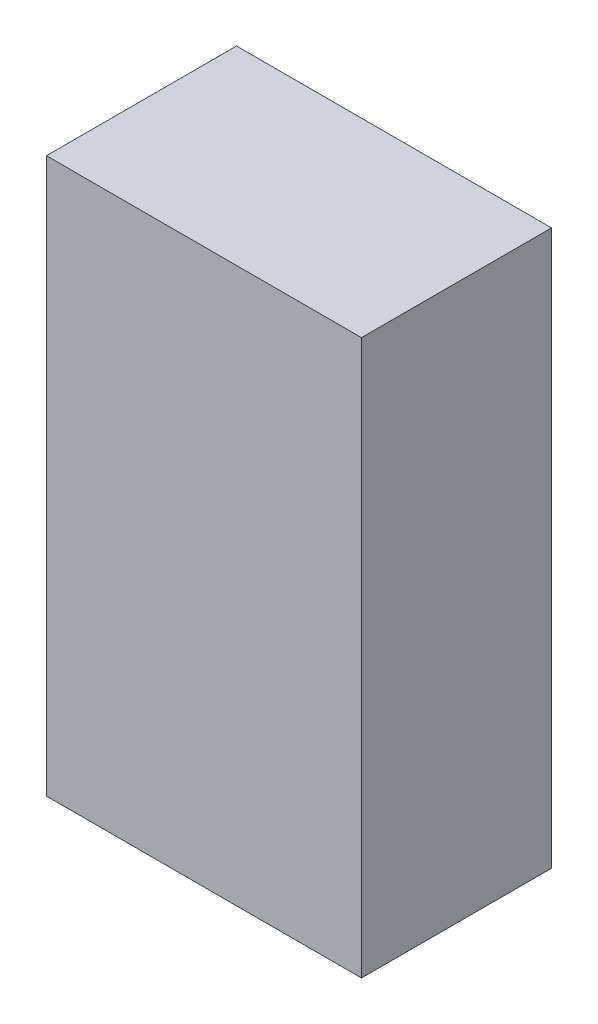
from build123d import *

# Parameters (mm, degrees)
SKETCH1_W           = 30.734
SKETCH1_H           = 54.102
BOSS_EXTRUDE1_DEPTH = 18.542


with BuildPart() as part:
    # Sketch1 → Boss-Extrude1 (new body)
    with BuildSketch(Plane.XY):
        Rectangle(SKETCH1_W, SKETCH1_H)
    extrude(amount=BOSS_EXTRUDE1_DEPTH)


solid = part.part
